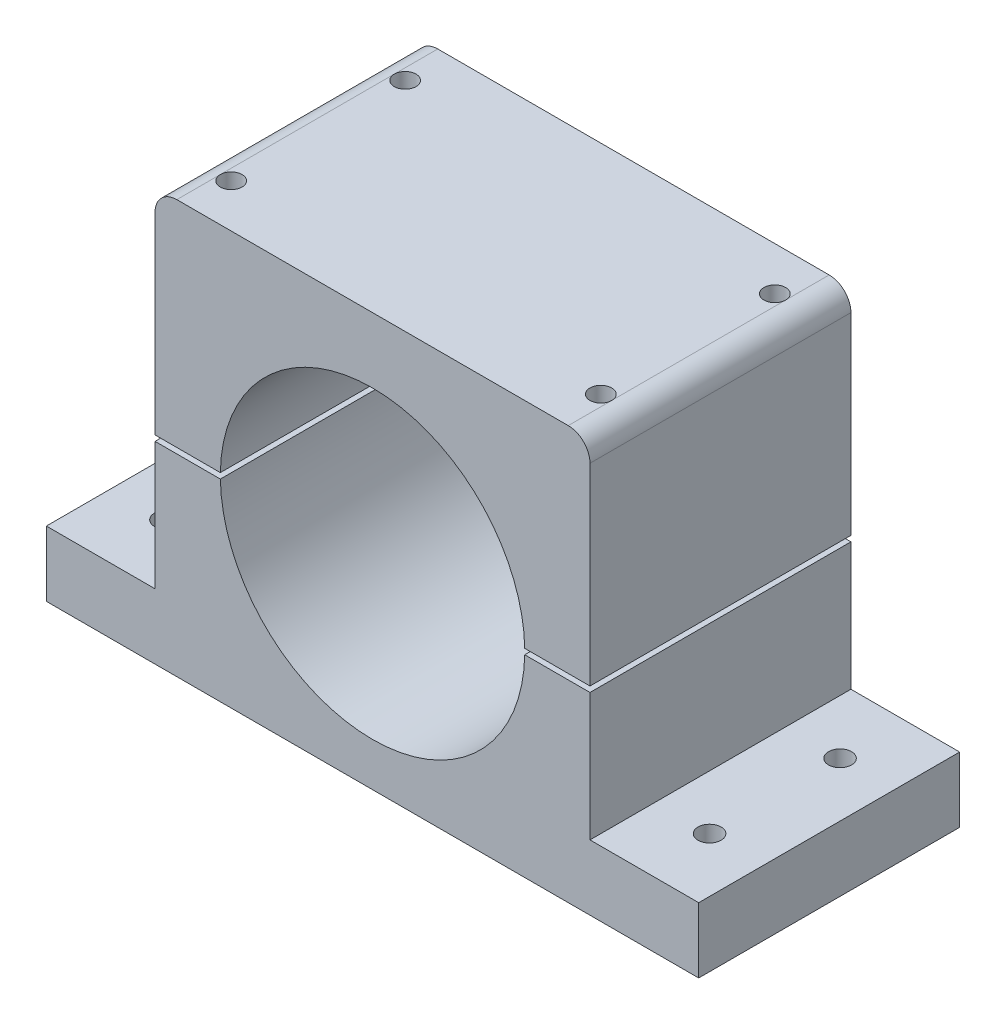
from build123d import *

# Parameters (mm, degrees)
SKETCH1_W           = 190.5
SKETCH1_H           = 120.65
BOSS_EXTRUDE1_DEPTH = 76.2
SKETCH2_R           = 44.449999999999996
CUT_EXTRUDE1_DEPTH  = 138.518189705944
CUT_EXTRUDE2_DEPTH  = 138.518189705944
SKETCH4_R           = 3.174999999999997
SKETCH4_R_2         = 3.1749999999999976
CUT_EXTRUDE3_DEPTH  = 76.2
SKETCH5_R           = 3.3654999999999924
SKETCH5_R_2         = 3.3654999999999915
CUT_EXTRUDE4_DEPTH  = 159.75
FILLET1_R           = 6.35
CUT_EXTRUDE6_DEPTH  = 138.518189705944


with BuildPart() as part:
    # Sketch1 → Boss-Extrude1 (new body)
    with BuildSketch(Plane.XY):
        with Locations((0, 3.175000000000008)):
            Rectangle(SKETCH1_W, SKETCH1_H)
    extrude(amount=-BOSS_EXTRUDE1_DEPTH)

    # Sketch2 → Cut-Extrude1 (cut, through all)
    with BuildSketch(Plane.XY):
        Circle(SKETCH2_R)
    extrude(amount=-CUT_EXTRUDE1_DEPTH, mode=Mode.SUBTRACT)

    # Sketch3 → Cut-Extrude2 (cut, through all)
    with BuildSketch(Plane.XY):
        Polygon((-95.25, 63.5), (-63.5, 63.5), (-63.499999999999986, -38.099999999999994), (-95.24999999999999, -38.099999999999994), align=None)
        Polygon((95.25, 63.5), (63.5, 63.5), (63.500000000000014, -38.1), (95.25000000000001, -38.099999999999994), align=None)
    extrude(amount=-CUT_EXTRUDE2_DEPTH, mode=Mode.SUBTRACT)

    # Sketch4 → Cut-Extrude3 (cut)
    with BuildSketch(Plane(origin=(0, 63.5, 0), x_dir=(1, 0, 0), z_dir=(0, 1, 0))):
        with Locations(Location((-53.974999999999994, 63.5, 0), (0, 0, 270))):
            Circle(SKETCH4_R)
        with Locations(Location((-53.974999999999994, 12.7, 0), (0, 0, 270))):
            Circle(SKETCH4_R_2)
        with Locations(Location((53.97499999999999, 63.5, 0), (0, 0, 270))):
            Circle(SKETCH4_R)
        with Locations(Location((53.97499999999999, 12.7, 0), (0, 0, 270))):
            Circle(SKETCH4_R_2)
    extrude(amount=-CUT_EXTRUDE3_DEPTH, mode=Mode.SUBTRACT)

    # Sketch5 → Cut-Extrude4 (cut, through all)
    with BuildSketch(Plane(origin=(0, -38.099999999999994, 0), x_dir=(1, 0, 0), z_dir=(0, 1, 0))):
        with Locations(Location((-79.37499999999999, 57.150000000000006, 0), (0, 0, 270))):
            Circle(SKETCH5_R)
        with Locations(Location((-79.37499999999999, 19.050000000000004, 0), (0, 0, 270))):
            Circle(SKETCH5_R_2)
        with Locations(Location((79.37500000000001, 57.150000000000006, 0), (0, 0, 270))):
            Circle(SKETCH5_R)
        with Locations(Location((79.37500000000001, 19.050000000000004, 0), (0, 0, 270))):
            Circle(SKETCH5_R_2)
    extrude(amount=-CUT_EXTRUDE4_DEPTH, mode=Mode.SUBTRACT)

    # Fillet1
    fillet1_edges = [part.edges().sort_by_distance(p)[0] for p in [
        (-63.5, 63.5, -38.1),
        (63.5, 63.5, -38.1),
    ]]
    fillet(fillet1_edges, radius=FILLET1_R)

    # Sketch6 → Cut-Extrude6 (cut, through all)
    with BuildSketch(Plane.XY):
        Polygon((-63.499999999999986, -0.8128000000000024), (63.5, -0.8127999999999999), (63.5, 0.8128000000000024), (-63.499999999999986, 0.8127999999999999), align=None)
    extrude(amount=-CUT_EXTRUDE6_DEPTH, mode=Mode.SUBTRACT)


with BuildPart() as cut_extrude6_piece_1:
    # of the separate pieces the step leaves, piece 1, a body of its own (cut_extrude6_pieces)
    add(part.part.solids().sort_by_distance((-63.5, -0.8128, 0))[0])


with BuildPart() as cut_extrude6_piece_2:
    # of the separate pieces the step leaves, piece 2, a body of its own (cut_extrude6_pieces)
    add(part.part.solids().sort_by_distance((-63.5, 57.15, 0))[0])


solid = Compound([cut_extrude6_piece_1.part, cut_extrude6_piece_2.part])
